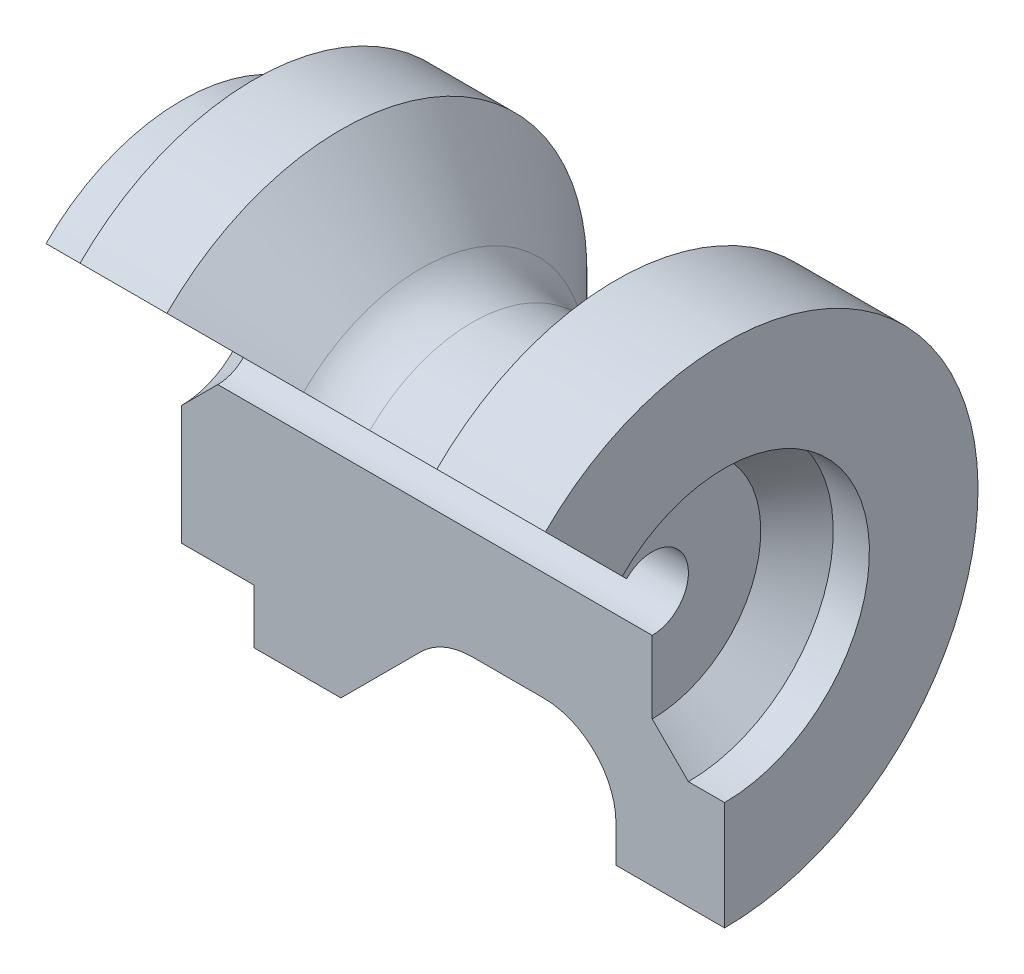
from build123d import *

# Parameters (mm, degrees)
REVOLVE1_ANGLE           = 180
REVOLVE1_OTHER_WAY_ANGLE = 45


with BuildPart() as part:
    # Sketch1 → Revolve1 (revolve)
    with BuildSketch(Plane.XY):
        with BuildLine():
            Line((5, 5), (0, 10))
            Line((0, 10), (0, 26.48575559))
            Line((0, 26.48575559), (10, 26.48575559))
            Line((10, 26.48575559), (10, 33.98695371))
            Line((10, 33.98695371), (22, 33.98695371))
            Line((22, 33.98695371), (33.058021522, 22.928932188))
            ThreePointArc((33.058021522, 22.928932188), (36.30225501, 20.761204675), (40.129089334, 20))
            Line((40.129089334, 20), (50, 20))
            ThreePointArc((50, 20), (57.071067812, 22.928932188), (60, 30))
            Line((60, 30), (60, 35))
            Line((60, 35), (75, 35))
            Line((75, 35), (75, 20))
            Line((75, 20), (70, 20))
            Line((70, 20), (65, 15))
            Line((65, 15), (65, 5))
            Line((65, 5), (5, 5))
        make_face()
    revolve(axis=Axis((0, 0, 0), (-1, 0, 0)), revolution_arc=REVOLVE1_ANGLE)

    # Sketch1 → Revolve1 other way (revolve)
    with BuildSketch(Plane.XY):
        with BuildLine():
            Line((5, 5), (0, 10))
            Line((0, 10), (0, 26.48575559))
            Line((0, 26.48575559), (10, 26.48575559))
            Line((10, 26.48575559), (10, 33.98695371))
            Line((10, 33.98695371), (22, 33.98695371))
            Line((22, 33.98695371), (33.058021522, 22.928932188))
            ThreePointArc((33.058021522, 22.928932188), (36.30225501, 20.761204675), (40.129089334, 20))
            Line((40.129089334, 20), (50, 20))
            ThreePointArc((50, 20), (57.071067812, 22.928932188), (60, 30))
            Line((60, 30), (60, 35))
            Line((60, 35), (75, 35))
            Line((75, 35), (75, 20))
            Line((75, 20), (70, 20))
            Line((70, 20), (65, 15))
            Line((65, 15), (65, 5))
            Line((65, 5), (5, 5))
        make_face()
    revolve(axis=Axis((0, 0, 0), (1, 0, 0)), revolution_arc=REVOLVE1_OTHER_WAY_ANGLE)


solid = part.part
